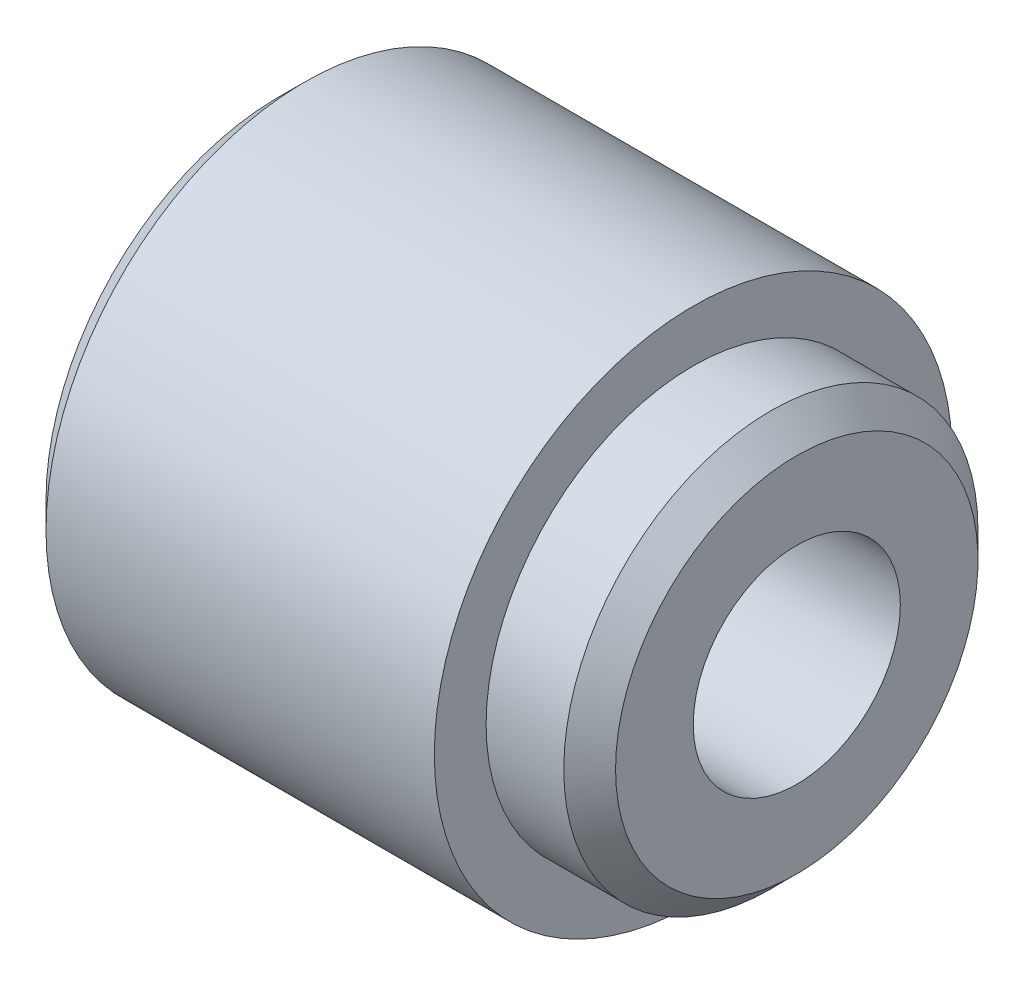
ISO-10303-21;
HEADER;
FILE_DESCRIPTION(('STEP AP214'),'2;1');
FILE_NAME('part.step','',(''),(''),'','','');
FILE_SCHEMA(('AUTOMOTIVE_DESIGN { 1 0 10303 214 1 1 1 1 }'));
ENDSEC;
DATA;
#1=APPLICATION_CONTEXT('core data for automotive mechanical design processes');
#2=APPLICATION_PROTOCOL_DEFINITION('international standard','automotive_design',2000,#1);
#3=PRODUCT_CONTEXT('',#1,'mechanical');
#4=PRODUCT('Part','Part','',(#3));
#5=PRODUCT_RELATED_PRODUCT_CATEGORY('part','',(#4));
#6=PRODUCT_DEFINITION_FORMATION('','',#4);
#7=PRODUCT_DEFINITION_CONTEXT('part definition',#1,'design');
#8=PRODUCT_DEFINITION('design','',#6,#7);
#9=PRODUCT_DEFINITION_SHAPE('','',#8);
#10=(LENGTH_UNIT() NAMED_UNIT(*) SI_UNIT(.MILLI.,.METRE.));
#11=(NAMED_UNIT(*) PLANE_ANGLE_UNIT() SI_UNIT($,.RADIAN.));
#12=(NAMED_UNIT(*) SI_UNIT($,.STERADIAN.) SOLID_ANGLE_UNIT());
#13=UNCERTAINTY_MEASURE_WITH_UNIT(LENGTH_MEASURE(1.E-05),#10,'distance_accuracy_value','');
#14=(GEOMETRIC_REPRESENTATION_CONTEXT(3) GLOBAL_UNCERTAINTY_ASSIGNED_CONTEXT((#13)) GLOBAL_UNIT_ASSIGNED_CONTEXT((#10,
#11,#12)) REPRESENTATION_CONTEXT('',''));
#15=CARTESIAN_POINT('',(0.,0.,0.));
#16=DIRECTION('',(0.,0.,1.));
#17=DIRECTION('',(1.,0.,0.));
#18=AXIS2_PLACEMENT_3D('',#15,#16,#17);
#19=CARTESIAN_POINT('',(-10.,9.,0.));
#20=DIRECTION('',(1.,0.,0.));
#21=DIRECTION('',(0.,0.,-1.));
#22=AXIS2_PLACEMENT_3D('',#19,#20,#21);
#23=PLANE('',#22);
#24=CARTESIAN_POINT('',(-10.,0.,0.));
#25=DIRECTION('',(-1.,0.,0.));
#26=DIRECTION('',(0.,0.,1.));
#27=AXIS2_PLACEMENT_3D('',#24,#25,#26);
#28=CIRCLE('',#27,4.);
#29=CARTESIAN_POINT('',(-10.,0.,4.));
#30=VERTEX_POINT('',#29);
#31=EDGE_CURVE('E10',#30,#30,#28,.T.);
#32=ORIENTED_EDGE('',*,*,#31,.F.);
#33=EDGE_LOOP('',(#32));
#34=FACE_BOUND('',#33,.T.);
#35=CARTESIAN_POINT('',(-10.,0.,0.));
#36=DIRECTION('',(-1.,0.,0.));
#37=DIRECTION('',(0.,0.,1.));
#38=AXIS2_PLACEMENT_3D('',#35,#36,#37);
#39=CIRCLE('',#38,9.);
#40=CARTESIAN_POINT('',(-10.,0.,9.));
#41=VERTEX_POINT('',#40);
#42=EDGE_CURVE('E58',#41,#41,#39,.T.);
#43=ORIENTED_EDGE('',*,*,#42,.T.);
#44=EDGE_LOOP('',(#43));
#45=FACE_BOUND('',#44,.T.);
#46=ADVANCED_FACE('F30',(#34,#45),#23,.F.);
#47=CARTESIAN_POINT('',(0.,0.,0.));
#48=DIRECTION('',(-1.,0.,0.));
#49=DIRECTION('',(0.,0.,1.));
#50=AXIS2_PLACEMENT_3D('',#47,#48,#49);
#51=CYLINDRICAL_SURFACE('',#50,4.);
#52=CARTESIAN_POINT('',(10.,0.,0.));
#53=DIRECTION('',(-1.,0.,0.));
#54=DIRECTION('',(0.,0.,1.));
#55=AXIS2_PLACEMENT_3D('',#52,#53,#54);
#56=CIRCLE('',#55,4.);
#57=CARTESIAN_POINT('',(10.,0.,4.));
#58=VERTEX_POINT('',#57);
#59=EDGE_CURVE('E36',#58,#58,#56,.T.);
#60=ORIENTED_EDGE('',*,*,#59,.F.);
#61=EDGE_LOOP('',(#60));
#62=FACE_BOUND('',#61,.T.);
#63=ORIENTED_EDGE('',*,*,#31,.T.);
#64=EDGE_LOOP('',(#63));
#65=FACE_BOUND('',#64,.T.);
#66=ADVANCED_FACE('F95',(#62,#65),#51,.F.);
#67=CARTESIAN_POINT('',(10.,7.00000000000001,0.));
#68=DIRECTION('',(-1.,0.,0.));
#69=DIRECTION('',(0.,0.,1.));
#70=AXIS2_PLACEMENT_3D('',#67,#68,#69);
#71=PLANE('',#70);
#72=CARTESIAN_POINT('',(10.,0.,0.));
#73=DIRECTION('',(-1.,0.,0.));
#74=DIRECTION('',(0.,0.,1.));
#75=AXIS2_PLACEMENT_3D('',#72,#73,#74);
#76=CIRCLE('',#75,7.00000000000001);
#77=CARTESIAN_POINT('',(10.,0.,7.00000000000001));
#78=VERTEX_POINT('',#77);
#79=EDGE_CURVE('E40',#78,#78,#76,.T.);
#80=ORIENTED_EDGE('',*,*,#79,.F.);
#81=EDGE_LOOP('',(#80));
#82=FACE_BOUND('',#81,.T.);
#83=ORIENTED_EDGE('',*,*,#59,.T.);
#84=EDGE_LOOP('',(#83));
#85=FACE_BOUND('',#84,.T.);
#86=ADVANCED_FACE('F90',(#82,#85),#71,.F.);
#87=CARTESIAN_POINT('',(10.,0.,0.));
#88=DIRECTION('',(-1.,0.,0.));
#89=DIRECTION('',(0.,0.,1.));
#90=AXIS2_PLACEMENT_3D('',#87,#88,#89);
#91=CONICAL_SURFACE('',#90,7.00000000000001,0.785398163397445);
#92=CARTESIAN_POINT('',(9.,0.,0.));
#93=DIRECTION('',(-1.,0.,0.));
#94=DIRECTION('',(0.,0.,1.));
#95=AXIS2_PLACEMENT_3D('',#92,#93,#94);
#96=CIRCLE('',#95,8.);
#97=CARTESIAN_POINT('',(9.,0.,8.));
#98=VERTEX_POINT('',#97);
#99=EDGE_CURVE('E44',#98,#98,#96,.T.);
#100=ORIENTED_EDGE('',*,*,#99,.F.);
#101=EDGE_LOOP('',(#100));
#102=FACE_BOUND('',#101,.T.);
#103=ORIENTED_EDGE('',*,*,#79,.T.);
#104=EDGE_LOOP('',(#103));
#105=FACE_BOUND('',#104,.T.);
#106=ADVANCED_FACE('F84',(#102,#105),#91,.T.);
#107=CARTESIAN_POINT('',(0.,0.,0.));
#108=DIRECTION('',(-1.,0.,0.));
#109=DIRECTION('',(0.,0.,1.));
#110=AXIS2_PLACEMENT_3D('',#107,#108,#109);
#111=CYLINDRICAL_SURFACE('',#110,8.);
#112=CARTESIAN_POINT('',(6.,0.,0.));
#113=DIRECTION('',(-1.,0.,0.));
#114=DIRECTION('',(0.,0.,1.));
#115=AXIS2_PLACEMENT_3D('',#112,#113,#114);
#116=CIRCLE('',#115,8.);
#117=CARTESIAN_POINT('',(6.,0.,8.));
#118=VERTEX_POINT('',#117);
#119=EDGE_CURVE('E49',#118,#118,#116,.T.);
#120=ORIENTED_EDGE('',*,*,#119,.F.);
#121=EDGE_LOOP('',(#120));
#122=FACE_BOUND('',#121,.T.);
#123=ORIENTED_EDGE('',*,*,#99,.T.);
#124=EDGE_LOOP('',(#123));
#125=FACE_BOUND('',#124,.T.);
#126=ADVANCED_FACE('F78',(#122,#125),#111,.T.);
#127=CARTESIAN_POINT('',(6.,10.,0.));
#128=DIRECTION('',(-1.,0.,0.));
#129=DIRECTION('',(0.,0.,1.));
#130=AXIS2_PLACEMENT_3D('',#127,#128,#129);
#131=PLANE('',#130);
#132=CARTESIAN_POINT('',(6.,0.,0.));
#133=DIRECTION('',(-1.,0.,0.));
#134=DIRECTION('',(0.,0.,1.));
#135=AXIS2_PLACEMENT_3D('',#132,#133,#134);
#136=CIRCLE('',#135,10.);
#137=CARTESIAN_POINT('',(6.,0.,10.));
#138=VERTEX_POINT('',#137);
#139=EDGE_CURVE('E52',#138,#138,#136,.T.);
#140=ORIENTED_EDGE('',*,*,#139,.F.);
#141=EDGE_LOOP('',(#140));
#142=FACE_BOUND('',#141,.T.);
#143=ORIENTED_EDGE('',*,*,#119,.T.);
#144=EDGE_LOOP('',(#143));
#145=FACE_BOUND('',#144,.T.);
#146=ADVANCED_FACE('F72',(#142,#145),#131,.F.);
#147=CARTESIAN_POINT('',(0.,0.,0.));
#148=DIRECTION('',(-1.,0.,0.));
#149=DIRECTION('',(0.,0.,1.));
#150=AXIS2_PLACEMENT_3D('',#147,#148,#149);
#151=CYLINDRICAL_SURFACE('',#150,10.);
#152=CARTESIAN_POINT('',(-9.00000000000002,0.,0.));
#153=DIRECTION('',(-1.,0.,0.));
#154=DIRECTION('',(0.,0.,1.));
#155=AXIS2_PLACEMENT_3D('',#152,#153,#154);
#156=CIRCLE('',#155,10.);
#157=CARTESIAN_POINT('',(-9.00000000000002,0.,10.));
#158=VERTEX_POINT('',#157);
#159=EDGE_CURVE('E55',#158,#158,#156,.T.);
#160=ORIENTED_EDGE('',*,*,#159,.F.);
#161=EDGE_LOOP('',(#160));
#162=FACE_BOUND('',#161,.T.);
#163=ORIENTED_EDGE('',*,*,#139,.T.);
#164=EDGE_LOOP('',(#163));
#165=FACE_BOUND('',#164,.T.);
#166=ADVANCED_FACE('F66',(#162,#165),#151,.T.);
#167=CARTESIAN_POINT('',(-9.00000000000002,0.,0.));
#168=DIRECTION('',(1.,0.,0.));
#169=DIRECTION('',(0.,0.,-1.));
#170=AXIS2_PLACEMENT_3D('',#167,#168,#169);
#171=CONICAL_SURFACE('',#170,10.,0.785398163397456);
#172=ORIENTED_EDGE('',*,*,#42,.F.);
#173=EDGE_LOOP('',(#172));
#174=FACE_BOUND('',#173,.T.);
#175=ORIENTED_EDGE('',*,*,#159,.T.);
#176=EDGE_LOOP('',(#175));
#177=FACE_BOUND('',#176,.T.);
#178=ADVANCED_FACE('F63',(#174,#177),#171,.T.);
#179=CLOSED_SHELL('',(#46,#66,#86,#106,#126,#146,#166,#178));
#180=MANIFOLD_SOLID_BREP('B2',#179);
#181=ADVANCED_BREP_SHAPE_REPRESENTATION('',(#18,#180),#14);
#182=SHAPE_DEFINITION_REPRESENTATION(#9,#181);
ENDSEC;
END-ISO-10303-21;
